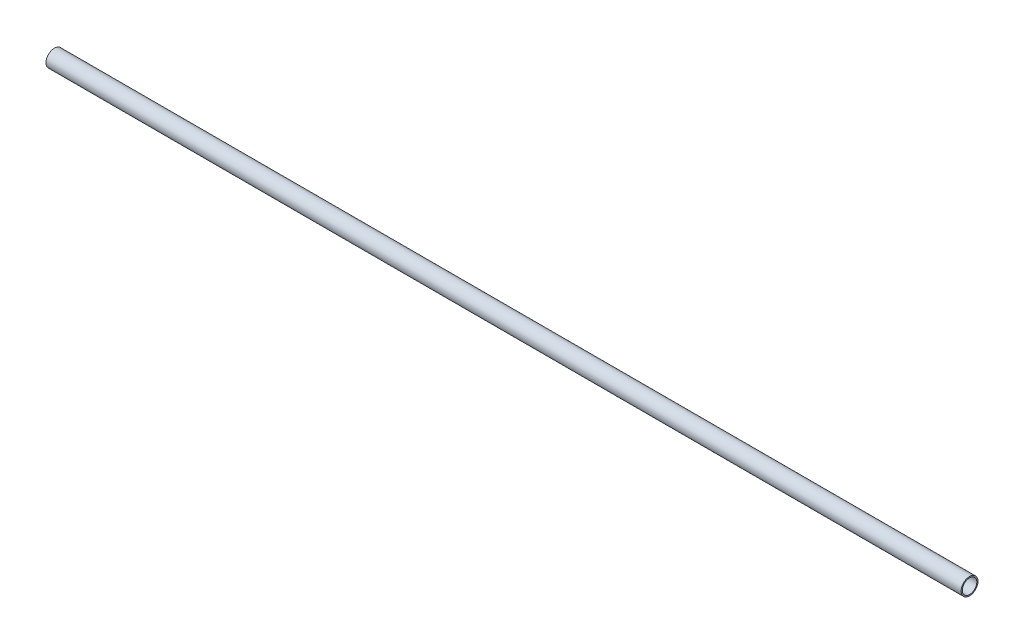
ISO-10303-21;
HEADER;
FILE_DESCRIPTION(('STEP AP214'),'2;1');
FILE_NAME('part.step','',(''),(''),'','','');
FILE_SCHEMA(('AUTOMOTIVE_DESIGN { 1 0 10303 214 1 1 1 1 }'));
ENDSEC;
DATA;
#1=APPLICATION_CONTEXT('core data for automotive mechanical design processes');
#2=APPLICATION_PROTOCOL_DEFINITION('international standard','automotive_design',2000,#1);
#3=PRODUCT_CONTEXT('',#1,'mechanical');
#4=PRODUCT('Part','Part','',(#3));
#5=PRODUCT_RELATED_PRODUCT_CATEGORY('part','',(#4));
#6=PRODUCT_DEFINITION_FORMATION('','',#4);
#7=PRODUCT_DEFINITION_CONTEXT('part definition',#1,'design');
#8=PRODUCT_DEFINITION('design','',#6,#7);
#9=PRODUCT_DEFINITION_SHAPE('','',#8);
#10=(LENGTH_UNIT() NAMED_UNIT(*) SI_UNIT(.MILLI.,.METRE.));
#11=(NAMED_UNIT(*) PLANE_ANGLE_UNIT() SI_UNIT($,.RADIAN.));
#12=(NAMED_UNIT(*) SI_UNIT($,.STERADIAN.) SOLID_ANGLE_UNIT());
#13=UNCERTAINTY_MEASURE_WITH_UNIT(LENGTH_MEASURE(1.E-05),#10,'distance_accuracy_value','');
#14=(GEOMETRIC_REPRESENTATION_CONTEXT(3) GLOBAL_UNCERTAINTY_ASSIGNED_CONTEXT((#13)) GLOBAL_UNIT_ASSIGNED_CONTEXT((#10,
#11,#12)) REPRESENTATION_CONTEXT('',''));
#15=CARTESIAN_POINT('',(0.,0.,0.));
#16=DIRECTION('',(0.,0.,1.));
#17=DIRECTION('',(1.,0.,0.));
#18=AXIS2_PLACEMENT_3D('',#15,#16,#17);
#19=CARTESIAN_POINT('',(380.,0.,0.));
#20=DIRECTION('',(1.,0.,0.));
#21=DIRECTION('',(0.,0.,-1.));
#22=AXIS2_PLACEMENT_3D('',#19,#20,#21);
#23=PLANE('',#22);
#24=CARTESIAN_POINT('',(380.,0.,0.));
#25=DIRECTION('',(1.,0.,0.));
#26=DIRECTION('',(0.,0.,-1.));
#27=AXIS2_PLACEMENT_3D('',#24,#25,#26);
#28=CIRCLE('',#27,7.00000000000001);
#29=CARTESIAN_POINT('',(380.,0.,-7.00000000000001));
#30=VERTEX_POINT('',#29);
#31=EDGE_CURVE('E10',#30,#30,#28,.T.);
#32=ORIENTED_EDGE('',*,*,#31,.T.);
#33=EDGE_LOOP('',(#32));
#34=FACE_BOUND('',#33,.T.);
#35=CARTESIAN_POINT('',(380.,0.,0.));
#36=DIRECTION('',(1.,0.,0.));
#37=DIRECTION('',(0.,0.,-1.));
#38=AXIS2_PLACEMENT_3D('',#35,#36,#37);
#39=CIRCLE('',#38,6.00000000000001);
#40=CARTESIAN_POINT('',(380.,0.,-6.00000000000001));
#41=VERTEX_POINT('',#40);
#42=EDGE_CURVE('E50',#41,#41,#39,.T.);
#43=ORIENTED_EDGE('',*,*,#42,.F.);
#44=EDGE_LOOP('',(#43));
#45=FACE_BOUND('',#44,.T.);
#46=ADVANCED_FACE('F37',(#34,#45),#23,.T.);
#47=CARTESIAN_POINT('',(-380.,0.,0.));
#48=DIRECTION('',(1.,0.,0.));
#49=DIRECTION('',(0.,0.,-1.));
#50=AXIS2_PLACEMENT_3D('',#47,#48,#49);
#51=PLANE('',#50);
#52=CARTESIAN_POINT('',(-380.,0.,0.));
#53=DIRECTION('',(1.,0.,0.));
#54=DIRECTION('',(0.,0.,-1.));
#55=AXIS2_PLACEMENT_3D('',#52,#53,#54);
#56=CIRCLE('',#55,7.00000000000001);
#57=CARTESIAN_POINT('',(-380.,0.,-7.00000000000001));
#58=VERTEX_POINT('',#57);
#59=EDGE_CURVE('E41',#58,#58,#56,.T.);
#60=ORIENTED_EDGE('',*,*,#59,.F.);
#61=EDGE_LOOP('',(#60));
#62=FACE_BOUND('',#61,.T.);
#63=CARTESIAN_POINT('',(-380.,0.,0.));
#64=DIRECTION('',(1.,0.,0.));
#65=DIRECTION('',(0.,0.,-1.));
#66=AXIS2_PLACEMENT_3D('',#63,#64,#65);
#67=CIRCLE('',#66,6.00000000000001);
#68=CARTESIAN_POINT('',(-380.,0.,-6.00000000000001));
#69=VERTEX_POINT('',#68);
#70=EDGE_CURVE('E52',#69,#69,#67,.T.);
#71=ORIENTED_EDGE('',*,*,#70,.T.);
#72=EDGE_LOOP('',(#71));
#73=FACE_BOUND('',#72,.T.);
#74=ADVANCED_FACE('F64',(#62,#73),#51,.F.);
#75=CARTESIAN_POINT('',(380.,0.,0.));
#76=DIRECTION('',(-1.,0.,0.));
#77=DIRECTION('',(0.,0.,1.));
#78=AXIS2_PLACEMENT_3D('',#75,#76,#77);
#79=CYLINDRICAL_SURFACE('',#78,7.00000000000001);
#80=ORIENTED_EDGE('',*,*,#31,.F.);
#81=EDGE_LOOP('',(#80));
#82=FACE_BOUND('',#81,.T.);
#83=ORIENTED_EDGE('',*,*,#59,.T.);
#84=EDGE_LOOP('',(#83));
#85=FACE_BOUND('',#84,.T.);
#86=ADVANCED_FACE('F39',(#82,#85),#79,.T.);
#87=CARTESIAN_POINT('',(380.,0.,0.));
#88=DIRECTION('',(-1.,0.,0.));
#89=DIRECTION('',(0.,0.,1.));
#90=AXIS2_PLACEMENT_3D('',#87,#88,#89);
#91=CYLINDRICAL_SURFACE('',#90,6.00000000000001);
#92=ORIENTED_EDGE('',*,*,#42,.T.);
#93=EDGE_LOOP('',(#92));
#94=FACE_BOUND('',#93,.T.);
#95=ORIENTED_EDGE('',*,*,#70,.F.);
#96=EDGE_LOOP('',(#95));
#97=FACE_BOUND('',#96,.T.);
#98=ADVANCED_FACE('F60',(#94,#97),#91,.F.);
#99=CLOSED_SHELL('',(#46,#74,#86,#98));
#100=MANIFOLD_SOLID_BREP('B2',#99);
#101=ADVANCED_BREP_SHAPE_REPRESENTATION('',(#18,#100),#14);
#102=SHAPE_DEFINITION_REPRESENTATION(#9,#101);
ENDSEC;
END-ISO-10303-21;
